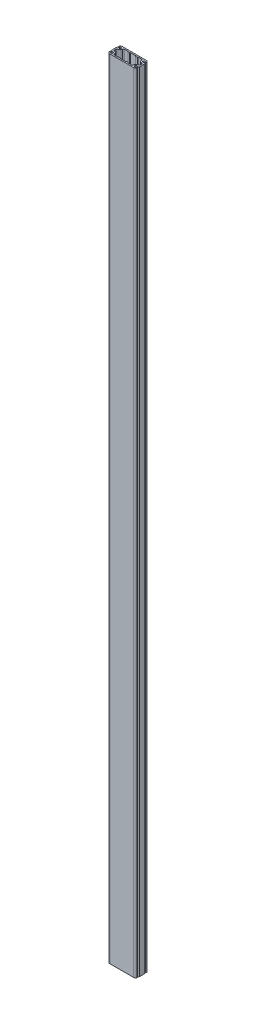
from build123d import *

# Parameters (mm, degrees)
SALIENTE_EXTRUIR1_DEPTH = 5000


with BuildPart() as part:
    # Croquis2 → Saliente-Extruir1 (new body)
    with BuildSketch(Plane(origin=(0, 0, 0), x_dir=(1, 0, 0), z_dir=(0, 1, 0))):
        with BuildLine():
            Line((90, -15.820430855), (90, 15.820430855))
            ThreePointArc((90, 15.820430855), (86.377431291, 21.479059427), (79.722019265, 20.557879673))
            ThreePointArc((79.722019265, 20.557879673), (69.104845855, 26.662756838), (81.19143785, 28.639671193))
            ThreePointArc((81.19143785, 28.639671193), (86.625966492, 27.069353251), (88.196284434, 32.503881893))
            ThreePointArc((88.196284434, 32.503881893), (82.872032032, 37.986118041), (75.5, 40))
            Line((75.5, 40), (-75.5, 40))
            ThreePointArc((-75.5, 40), (-82.872032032, 37.986118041), (-88.196284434, 32.503881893))
            ThreePointArc((-88.196284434, 32.503881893), (-86.625966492, 27.069353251), (-81.19143785, 28.639671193))
            ThreePointArc((-81.19143785, 28.639671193), (-69.104845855, 26.662756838), (-79.722019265, 20.557879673))
            ThreePointArc((-79.722019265, 20.557879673), (-86.377431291, 21.479059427), (-90, 15.820430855))
            Line((-90, 15.820430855), (-90, -15.820430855))
            ThreePointArc((-90, -15.820430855), (-86.377431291, -21.479059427), (-79.722019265, -20.557879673))
            ThreePointArc((-79.722019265, -20.557879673), (-69.104845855, -26.662756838), (-81.19143785, -28.639671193))
            ThreePointArc((-81.19143785, -28.639671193), (-86.625966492, -27.069353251), (-88.196284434, -32.503881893))
            ThreePointArc((-88.196284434, -32.503881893), (-82.872032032, -37.986118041), (-75.5, -40))
            Line((-75.5, -40), (75.5, -40))
            ThreePointArc((75.5, -40), (82.872032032, -37.986118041), (88.196284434, -32.503881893))
            ThreePointArc((88.196284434, -32.503881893), (86.625966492, -27.069353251), (81.19143785, -28.639671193))
            ThreePointArc((81.19143785, -28.639671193), (69.104845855, -26.662756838), (79.722019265, -20.557879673))
            ThreePointArc((79.722019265, -20.557879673), (86.377431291, -21.479059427), (90, -15.820430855))
        make_face()
        with BuildLine():
            Line((-17.482701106, 32), (17.482701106, 32))
            Line((17.482701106, 32), (20, 29))
            Line((20, 29), (30, 29))
            Line((30, 29), (32.517298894, 32))
            Line((32.517298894, 32), (54.5, 32))
            ThreePointArc((54.5, 32), (59.096194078, 30.096194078), (61, 25.5))
            ThreePointArc((61, 25.5), (65.246951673, 15.246951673), (75.5, 11))
            ThreePointArc((75.5, 11), (80.096194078, 9.096194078), (82, 4.5))
            Line((82, 4.5), (82, -4.5))
            ThreePointArc((82, -4.5), (80.096194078, -9.096194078), (75.5, -11))
            ThreePointArc((75.5, -11), (65.246951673, -15.246951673), (61, -25.5))
            ThreePointArc((61, -25.5), (59.096194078, -30.096194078), (54.5, -32))
            Line((54.5, -32), (32.517298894, -32))
            Line((32.517298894, -32), (30, -29))
            Line((30, -29), (20, -29))
            Line((20, -29), (17.482701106, -32))
            Line((17.482701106, -32), (-17.482701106, -32))
            Line((-17.482701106, -32), (-20, -29))
            Line((-20, -29), (-30, -29))
            Line((-30, -29), (-32.517298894, -32))
            Line((-32.517298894, -32), (-54.5, -32))
            ThreePointArc((-54.5, -32), (-59.096194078, -30.096194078), (-61, -25.5))
            ThreePointArc((-61, -25.5), (-65.246951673, -15.246951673), (-75.5, -11))
            ThreePointArc((-75.5, -11), (-80.096194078, -9.096194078), (-82, -4.5))
            Line((-82, -4.5), (-82, 4.5))
            ThreePointArc((-82, 4.5), (-80.096194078, 9.096194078), (-75.5, 11))
            ThreePointArc((-75.5, 11), (-65.246951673, 15.246951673), (-61, 25.5))
            ThreePointArc((-61, 25.5), (-59.096194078, 30.096194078), (-54.5, 32))
            Line((-54.5, 32), (-32.517298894, 32))
            Line((-32.517298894, 32), (-30, 29))
            Line((-30, 29), (-20, 29))
            Line((-20, 29), (-17.482701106, 32))
        make_face(mode=Mode.SUBTRACT)
    extrude(amount=SALIENTE_EXTRUIR1_DEPTH)


solid = part.part
